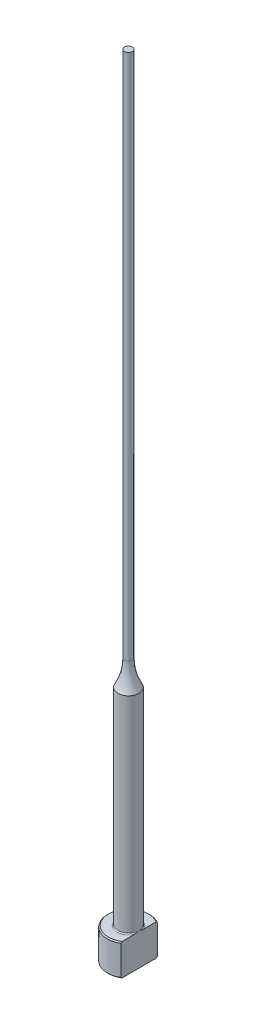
ISO-10303-21;
HEADER;
FILE_DESCRIPTION(('STEP AP214'),'2;1');
FILE_NAME('part.step','',(''),(''),'','','');
FILE_SCHEMA(('AUTOMOTIVE_DESIGN { 1 0 10303 214 1 1 1 1 }'));
ENDSEC;
DATA;
#1=APPLICATION_CONTEXT('core data for automotive mechanical design processes');
#2=APPLICATION_PROTOCOL_DEFINITION('international standard','automotive_design',2000,#1);
#3=PRODUCT_CONTEXT('',#1,'mechanical');
#4=PRODUCT('Part','Part','',(#3));
#5=PRODUCT_RELATED_PRODUCT_CATEGORY('part','',(#4));
#6=PRODUCT_DEFINITION_FORMATION('','',#4);
#7=PRODUCT_DEFINITION_CONTEXT('part definition',#1,'design');
#8=PRODUCT_DEFINITION('design','',#6,#7);
#9=PRODUCT_DEFINITION_SHAPE('','',#8);
#10=(LENGTH_UNIT() NAMED_UNIT(*) SI_UNIT(.MILLI.,.METRE.));
#11=(NAMED_UNIT(*) PLANE_ANGLE_UNIT() SI_UNIT($,.RADIAN.));
#12=(NAMED_UNIT(*) SI_UNIT($,.STERADIAN.) SOLID_ANGLE_UNIT());
#13=UNCERTAINTY_MEASURE_WITH_UNIT(LENGTH_MEASURE(1.E-05),#10,'distance_accuracy_value','');
#14=(GEOMETRIC_REPRESENTATION_CONTEXT(3) GLOBAL_UNCERTAINTY_ASSIGNED_CONTEXT((#13)) GLOBAL_UNIT_ASSIGNED_CONTEXT((#10,
#11,#12)) REPRESENTATION_CONTEXT('',''));
#15=CARTESIAN_POINT('',(0.,0.,0.));
#16=DIRECTION('',(0.,0.,1.));
#17=DIRECTION('',(1.,0.,0.));
#18=AXIS2_PLACEMENT_3D('',#15,#16,#17);
#19=CARTESIAN_POINT('',(-3.99999999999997,6.,0.));
#20=DIRECTION('',(0.,1.,0.));
#21=DIRECTION('',(0.,0.,1.));
#22=AXIS2_PLACEMENT_3D('',#19,#20,#21);
#23=PLANE('',#22);
#24=CARTESIAN_POINT('',(0.,6.,0.));
#25=DIRECTION('',(0.,1.,0.));
#26=DIRECTION('',(0.,0.,1.));
#27=AXIS2_PLACEMENT_3D('',#24,#25,#26);
#28=CIRCLE('',#27,3.79999999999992);
#29=CARTESIAN_POINT('',(1.99999999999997,6.,-3.23109888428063));
#30=VERTEX_POINT('',#29);
#31=CARTESIAN_POINT('',(1.99999999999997,6.,3.23109888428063));
#32=VERTEX_POINT('',#31);
#33=EDGE_CURVE('E187',#30,#32,#28,.T.);
#34=ORIENTED_EDGE('',*,*,#33,.T.);
#35=DIRECTION('',(0.,0.,-1.));
#36=VECTOR('',#35,1.);
#37=CARTESIAN_POINT('',(1.99999999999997,6.,0.));
#38=LINE('',#37,#36);
#39=CARTESIAN_POINT('',(1.99999999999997,5.99999999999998,0.916515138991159));
#40=VERTEX_POINT('',#39);
#41=EDGE_CURVE('E57',#32,#40,#38,.T.);
#42=ORIENTED_EDGE('',*,*,#41,.T.);
#43=CARTESIAN_POINT('',(0.,6.,0.));
#44=DIRECTION('',(0.,1.,0.));
#45=DIRECTION('',(0.,0.,1.));
#46=AXIS2_PLACEMENT_3D('',#43,#44,#45);
#47=CIRCLE('',#46,2.19999999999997);
#48=CARTESIAN_POINT('',(1.99999999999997,5.99999999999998,-0.916515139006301));
#49=VERTEX_POINT('',#48);
#50=EDGE_CURVE('E108',#40,#49,#47,.F.);
#51=ORIENTED_EDGE('',*,*,#50,.T.);
#52=EDGE_CURVE('E137',#49,#30,#38,.T.);
#53=ORIENTED_EDGE('',*,*,#52,.T.);
#54=EDGE_LOOP('',(#34,#42,#51,#53));
#55=FACE_BOUND('',#54,.T.);
#56=ADVANCED_FACE('F32',(#55),#23,.T.);
#57=CARTESIAN_POINT('',(0.,259.958771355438,0.));
#58=DIRECTION('',(0.,1.,0.));
#59=DIRECTION('',(0.,0.,1.));
#60=AXIS2_PLACEMENT_3D('',#57,#58,#59);
#61=CYLINDRICAL_SURFACE('',#60,3.99999999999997);
#62=CARTESIAN_POINT('',(0.,5.79999999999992,0.));
#63=DIRECTION('',(0.,1.,0.));
#64=DIRECTION('',(0.,0.,1.));
#65=AXIS2_PLACEMENT_3D('',#62,#63,#64);
#66=CIRCLE('',#65,3.99999999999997);
#67=CARTESIAN_POINT('',(1.99999999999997,5.79999999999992,3.46410161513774));
#68=VERTEX_POINT('',#67);
#69=CARTESIAN_POINT('',(1.99999999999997,5.79999999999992,-3.46410161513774));
#70=VERTEX_POINT('',#69);
#71=EDGE_CURVE('E105',#68,#70,#66,.F.);
#72=ORIENTED_EDGE('',*,*,#71,.T.);
#73=DIRECTION('',(0.,-1.,0.));
#74=VECTOR('',#73,1.);
#75=CARTESIAN_POINT('',(1.99999999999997,150.,-3.46410161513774));
#76=LINE('',#75,#74);
#77=CARTESIAN_POINT('',(1.99999999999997,0.199999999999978,-3.46410161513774));
#78=VERTEX_POINT('',#77);
#79=EDGE_CURVE('E193',#70,#78,#76,.T.);
#80=ORIENTED_EDGE('',*,*,#79,.T.);
#81=CARTESIAN_POINT('',(0.,0.199999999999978,0.));
#82=DIRECTION('',(0.,-1.,0.));
#83=DIRECTION('',(0.,0.,-1.));
#84=AXIS2_PLACEMENT_3D('',#81,#82,#83);
#85=CIRCLE('',#84,3.99999999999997);
#86=CARTESIAN_POINT('',(1.99999999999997,0.199999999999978,3.46410161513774));
#87=VERTEX_POINT('',#86);
#88=EDGE_CURVE('E100',#78,#87,#85,.F.);
#89=ORIENTED_EDGE('',*,*,#88,.T.);
#90=DIRECTION('',(0.,-1.,0.));
#91=VECTOR('',#90,1.);
#92=CARTESIAN_POINT('',(1.99999999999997,150.,3.46410161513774));
#93=LINE('',#92,#91);
#94=EDGE_CURVE('E93',#68,#87,#93,.T.);
#95=ORIENTED_EDGE('',*,*,#94,.F.);
#96=EDGE_LOOP('',(#72,#80,#89,#95));
#97=FACE_BOUND('',#96,.T.);
#98=ADVANCED_FACE('F158',(#97),#61,.T.);
#99=CARTESIAN_POINT('',(0.,0.,0.));
#100=DIRECTION('',(0.,-1.,0.));
#101=DIRECTION('',(0.,0.,-1.));
#102=AXIS2_PLACEMENT_3D('',#99,#100,#101);
#103=PLANE('',#102);
#104=CARTESIAN_POINT('',(0.,0.,0.));
#105=DIRECTION('',(0.,-1.,0.));
#106=DIRECTION('',(0.,0.,-1.));
#107=AXIS2_PLACEMENT_3D('',#104,#105,#106);
#108=CIRCLE('',#107,3.79999999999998);
#109=CARTESIAN_POINT('',(1.99999999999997,0.,3.2310988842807));
#110=VERTEX_POINT('',#109);
#111=CARTESIAN_POINT('',(1.99999999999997,0.,-3.2310988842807));
#112=VERTEX_POINT('',#111);
#113=EDGE_CURVE('E98',#110,#112,#108,.T.);
#114=ORIENTED_EDGE('',*,*,#113,.T.);
#115=DIRECTION('',(0.,0.,1.));
#116=VECTOR('',#115,1.);
#117=CARTESIAN_POINT('',(1.99999999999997,0.,3.46410161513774));
#118=LINE('',#117,#116);
#119=EDGE_CURVE('E83',#112,#110,#118,.T.);
#120=ORIENTED_EDGE('',*,*,#119,.T.);
#121=EDGE_LOOP('',(#114,#120));
#122=FACE_BOUND('',#121,.T.);
#123=ADVANCED_FACE('F103',(#122),#103,.T.);
#124=CARTESIAN_POINT('',(0.,6.00000000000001,0.));
#125=DIRECTION('',(0.,-1.,0.));
#126=DIRECTION('',(0.,0.,-1.));
#127=AXIS2_PLACEMENT_3D('',#124,#125,#126);
#128=CONICAL_SURFACE('',#127,3.79999999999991,0.785398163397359);
#129=ORIENTED_EDGE('',*,*,#71,.F.);
#130=CARTESIAN_POINT('',(1.99999999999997,1.91904532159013,7.62295524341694));
#131=CARTESIAN_POINT('',(1.99999999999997,2.08611243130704,7.4502239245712));
#132=CARTESIAN_POINT('',(1.99999999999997,2.25300024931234,7.27731861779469));
#133=CARTESIAN_POINT('',(1.99999999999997,2.58631125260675,6.93105655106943));
#134=CARTESIAN_POINT('',(1.99999999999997,2.75273443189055,6.75769978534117));
#135=CARTESIAN_POINT('',(1.99999999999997,3.08509080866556,6.41034692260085));
#136=CARTESIAN_POINT('',(1.99999999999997,3.25102371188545,6.23635054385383));
#137=CARTESIAN_POINT('',(1.99999999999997,3.5821559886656,5.88766284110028));
#138=CARTESIAN_POINT('',(1.99999999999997,3.74735536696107,5.71297152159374));
#139=CARTESIAN_POINT('',(1.99999999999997,4.07353855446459,5.36616839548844));
#140=CARTESIAN_POINT('',(1.99999999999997,4.23454099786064,5.19407412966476));
#141=CARTESIAN_POINT('',(1.99999999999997,4.55534102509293,4.8487666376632));
#142=CARTESIAN_POINT('',(1.99999999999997,4.71513861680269,4.67555341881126));
#143=CARTESIAN_POINT('',(1.99999999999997,5.0330618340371,4.3276656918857));
#144=CARTESIAN_POINT('',(1.99999999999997,5.1911878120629,4.15299150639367));
#145=CARTESIAN_POINT('',(1.99999999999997,5.50513944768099,3.80159134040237));
#146=CARTESIAN_POINT('',(1.99999999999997,5.66096519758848,3.62486544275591));
#147=CARTESIAN_POINT('',(1.99999999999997,5.90974646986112,3.33722425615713));
#148=CARTESIAN_POINT('',(1.99999999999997,6.00376148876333,3.22722645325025));
#149=CARTESIAN_POINT('',(1.99999999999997,6.19011825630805,3.00579987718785));
#150=CARTESIAN_POINT('',(1.99999999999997,6.28245983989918,2.89437096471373));
#151=CARTESIAN_POINT('',(1.99999999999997,6.46586188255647,2.66849662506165));
#152=CARTESIAN_POINT('',(1.99999999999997,6.55689849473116,2.55403176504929));
#153=CARTESIAN_POINT('',(1.99999999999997,6.73578809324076,2.32266819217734));
#154=CARTESIAN_POINT('',(1.99999999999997,6.82364184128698,2.20577007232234));
#155=CARTESIAN_POINT('',(1.99999999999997,6.99612756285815,1.96688707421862));
#156=CARTESIAN_POINT('',(1.99999999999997,7.08069035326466,1.84485190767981));
#157=CARTESIAN_POINT('',(1.99999999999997,7.24300264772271,1.59599329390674));
#158=CARTESIAN_POINT('',(1.99999999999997,7.32074277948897,1.46916359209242));
#159=CARTESIAN_POINT('',(1.99999999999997,7.42869763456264,1.27510066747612));
#160=CARTESIAN_POINT('',(1.99999999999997,7.46305374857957,1.21018943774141));
#161=CARTESIAN_POINT('',(1.99999999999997,7.52837146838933,1.07868835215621));
#162=CARTESIAN_POINT('',(1.99999999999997,7.55933245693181,1.01209819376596));
#163=CARTESIAN_POINT('',(1.99999999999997,7.64566860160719,0.809894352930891));
#164=CARTESIAN_POINT('',(1.99999999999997,7.69478214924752,0.6713602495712));
#165=CARTESIAN_POINT('',(1.99999999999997,7.74794829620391,0.463657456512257));
#166=CARTESIAN_POINT('',(1.99999999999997,7.76205065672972,0.397033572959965));
#167=CARTESIAN_POINT('',(1.99999999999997,7.78390371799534,0.262728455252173));
#168=CARTESIAN_POINT('',(1.99999999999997,7.79165498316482,0.195047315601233));
#169=CARTESIAN_POINT('',(1.99999999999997,7.80025690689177,0.0594528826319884));
#170=CARTESIAN_POINT('',(1.99999999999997,7.80112894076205,-0.00845903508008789));
#171=CARTESIAN_POINT('',(1.99999999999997,7.79596585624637,-0.144020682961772));
#172=CARTESIAN_POINT('',(1.99999999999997,7.78993016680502,-0.211670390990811));
#173=CARTESIAN_POINT('',(1.99999999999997,7.77145363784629,-0.345483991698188));
#174=CARTESIAN_POINT('',(1.99999999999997,7.7590677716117,-0.41165563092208));
#175=CARTESIAN_POINT('',(1.99999999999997,7.72866360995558,-0.542678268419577));
#176=CARTESIAN_POINT('',(1.99999999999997,7.71064463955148,-0.607529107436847));
#177=CARTESIAN_POINT('',(1.99999999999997,7.6697293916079,-0.736064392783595));
#178=CARTESIAN_POINT('',(1.99999999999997,7.64680564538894,-0.799739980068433));
#179=CARTESIAN_POINT('',(1.99999999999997,7.59700147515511,-0.925489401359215));
#180=CARTESIAN_POINT('',(1.99999999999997,7.57012185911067,-0.98756355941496));
#181=CARTESIAN_POINT('',(1.99999999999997,7.48443518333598,-1.17209020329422));
#182=CARTESIAN_POINT('',(1.99999999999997,7.42077407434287,-1.29228210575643));
#183=CARTESIAN_POINT('',(1.99999999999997,7.28502644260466,-1.52785770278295));
#184=CARTESIAN_POINT('',(1.99999999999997,7.21292931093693,-1.6432350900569));
#185=CARTESIAN_POINT('',(1.99999999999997,7.06281517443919,-1.87069387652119));
#186=CARTESIAN_POINT('',(1.99999999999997,6.98477595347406,-1.98276048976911));
#187=CARTESIAN_POINT('',(1.99999999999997,6.82481971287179,-2.20397837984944));
#188=CARTESIAN_POINT('',(1.99999999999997,6.74290465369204,-2.31313108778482));
#189=CARTESIAN_POINT('',(1.99999999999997,6.57517222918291,-2.53068545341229));
#190=CARTESIAN_POINT('',(1.99999999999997,6.4893176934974,-2.63905831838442));
#191=CARTESIAN_POINT('',(1.99999999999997,6.31548151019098,-2.85409686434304));
#192=CARTESIAN_POINT('',(1.99999999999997,6.22749963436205,-2.96076236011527));
#193=CARTESIAN_POINT('',(1.99999999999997,6.05015030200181,-3.17249211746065));
#194=CARTESIAN_POINT('',(1.99999999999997,5.96078672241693,-3.27755963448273));
#195=CARTESIAN_POINT('',(1.99999999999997,5.78082366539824,-3.48663191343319));
#196=CARTESIAN_POINT('',(1.99999999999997,5.69022416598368,-3.59063665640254));
#197=CARTESIAN_POINT('',(1.99999999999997,5.44796733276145,-3.86612439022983));
#198=CARTESIAN_POINT('',(1.99999999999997,5.29545972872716,-4.0368591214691));
#199=CARTESIAN_POINT('',(1.99999999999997,4.98858070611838,-4.37664803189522));
#200=CARTESIAN_POINT('',(1.99999999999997,4.83420923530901,-4.54570216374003));
#201=CARTESIAN_POINT('',(1.99999999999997,4.52396102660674,-4.88271638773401));
#202=CARTESIAN_POINT('',(1.99999999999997,4.36808300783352,-5.05067529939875));
#203=CARTESIAN_POINT('',(1.99999999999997,4.05530513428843,-5.38563883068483));
#204=CARTESIAN_POINT('',(1.99999999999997,3.8984052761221,-5.55264344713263));
#205=CARTESIAN_POINT('',(1.99999999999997,3.59029018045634,-5.87905385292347));
#206=CARTESIAN_POINT('',(1.99999999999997,3.43910664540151,-6.03848959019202));
#207=CARTESIAN_POINT('',(1.99999999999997,3.13616436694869,-6.35681456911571));
#208=CARTESIAN_POINT('',(1.99999999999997,2.98440562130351,-6.51570380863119));
#209=CARTESIAN_POINT('',(1.99999999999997,2.68059501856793,-6.83286192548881));
#210=CARTESIAN_POINT('',(1.99999999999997,2.52854367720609,-6.99113129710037));
#211=CARTESIAN_POINT('',(1.99999999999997,2.22406035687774,-7.30730102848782));
#212=CARTESIAN_POINT('',(1.99999999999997,2.07162838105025,-7.46520139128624));
#213=CARTESIAN_POINT('',(1.99999999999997,1.91904532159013,-7.62295524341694));
#214=B_SPLINE_CURVE_WITH_KNOTS('',3,(#130,#131,#132,#133,#134,#135,#136,#137,#138,#139,#140,
#141,#142,#143,#144,#145,#146,#147,#148,#149,#150,#151,#152,#153,#154,#155,#156,#157,#158,#159,
#160,#161,#162,#163,#164,#165,#166,#167,#168,#169,#170,#171,#172,#173,#174,#175,#176,#177,#178,
#179,#180,#181,#182,#183,#184,#185,#186,#187,#188,#189,#190,#191,#192,#193,#194,#195,#196,#197,
#198,#199,#200,#201,#202,#203,#204,#205,#206,#207,#208,#209,#210,#211,#212,#213),.UNSPECIFIED.,
.F.,.F.,(4,2,2,2,2,2,2,2,2,2,2,2,2,2,2,2,2,2,2,2,2,2,2,2,2,2,2,2,2,2,2,2,2,2,2,2,2,2,2,2,2,4),
(0.,0.720921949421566,1.44185317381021,2.16315326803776,2.88444869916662,3.59144103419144,
4.29842874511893,5.00526427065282,5.71207135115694,6.14616174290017,6.58029471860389,
7.01901494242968,7.45762947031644,7.90290456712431,8.34878206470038,8.56901415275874,
8.78928621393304,9.22814472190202,9.43219512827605,9.63622739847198,9.839625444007,
10.0430403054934,10.244723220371,10.4464303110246,10.6492980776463,10.8521244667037,
11.2595582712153,11.6675100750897,12.0770700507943,12.4864250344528,12.9011677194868,
13.3159550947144,13.7297367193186,14.1435257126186,14.8302935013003,15.5170805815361,
16.2045145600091,16.891950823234,17.5511045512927,18.2102608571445,18.8686819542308,
19.5270976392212),.UNSPECIFIED.);
#215=EDGE_CURVE('E136',#68,#32,#214,.T.);
#216=ORIENTED_EDGE('',*,*,#215,.T.);
#217=ORIENTED_EDGE('',*,*,#33,.F.);
#218=EDGE_CURVE('E128',#30,#70,#214,.T.);
#219=ORIENTED_EDGE('',*,*,#218,.T.);
#220=EDGE_LOOP('',(#129,#216,#217,#219));
#221=FACE_BOUND('',#220,.T.);
#222=ADVANCED_FACE('F144',(#221),#128,.T.);
#223=CARTESIAN_POINT('',(0.,0.199999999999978,0.));
#224=DIRECTION('',(0.,1.,0.));
#225=DIRECTION('',(0.,0.,1.));
#226=AXIS2_PLACEMENT_3D('',#223,#224,#225);
#227=CONICAL_SURFACE('',#226,3.99999999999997,0.785398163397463);
#228=ORIENTED_EDGE('',*,*,#88,.F.);
#229=CARTESIAN_POINT('',(1.99999999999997,4.08095467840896,-7.62295524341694));
#230=CARTESIAN_POINT('',(1.99999999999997,3.9138875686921,-7.45022392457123));
#231=CARTESIAN_POINT('',(1.99999999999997,3.74699975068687,-7.27731861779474));
#232=CARTESIAN_POINT('',(1.99999999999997,3.41368874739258,-6.93105655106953));
#233=CARTESIAN_POINT('',(1.99999999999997,3.24726556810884,-6.7576997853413));
#234=CARTESIAN_POINT('',(1.99999999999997,2.91490919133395,-6.41034692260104));
#235=CARTESIAN_POINT('',(1.99999999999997,2.74897628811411,-6.23635054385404));
#236=CARTESIAN_POINT('',(1.99999999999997,2.41784401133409,-5.88766284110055));
#237=CARTESIAN_POINT('',(1.99999999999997,2.25264463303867,-5.71297152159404));
#238=CARTESIAN_POINT('',(1.99999999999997,1.92646144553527,-5.36616839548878));
#239=CARTESIAN_POINT('',(1.99999999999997,1.76545900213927,-5.19407412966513));
#240=CARTESIAN_POINT('',(1.99999999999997,1.44465897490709,-4.84876663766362));
#241=CARTESIAN_POINT('',(1.99999999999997,1.28486138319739,-4.6755534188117));
#242=CARTESIAN_POINT('',(1.99999999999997,0.966938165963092,-4.3276656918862));
#243=CARTESIAN_POINT('',(1.99999999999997,0.808812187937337,-4.1529915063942));
#244=CARTESIAN_POINT('',(1.99999999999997,0.49486055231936,-3.80159134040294));
#245=CARTESIAN_POINT('',(1.99999999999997,0.33903480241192,-3.62486544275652));
#246=CARTESIAN_POINT('',(1.99999999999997,0.0902535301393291,-3.33722425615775));
#247=CARTESIAN_POINT('',(1.99999999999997,-0.0037614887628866,-3.22722645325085));
#248=CARTESIAN_POINT('',(1.99999999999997,-0.190118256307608,-3.00579987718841));
#249=CARTESIAN_POINT('',(1.99999999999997,-0.282459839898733,-2.89437096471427));
#250=CARTESIAN_POINT('',(1.99999999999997,-0.465861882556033,-2.66849662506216));
#251=CARTESIAN_POINT('',(1.99999999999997,-0.556898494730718,-2.55403176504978));
#252=CARTESIAN_POINT('',(1.99999999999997,-0.735788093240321,-2.3226681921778));
#253=CARTESIAN_POINT('',(1.99999999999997,-0.823641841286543,-2.20577007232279));
#254=CARTESIAN_POINT('',(1.99999999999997,-0.99612756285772,-1.96688707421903));
#255=CARTESIAN_POINT('',(1.99999999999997,-1.08069035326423,-1.84485190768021));
#256=CARTESIAN_POINT('',(1.99999999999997,-1.24300264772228,-1.59599329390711));
#257=CARTESIAN_POINT('',(1.99999999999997,-1.32074277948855,-1.46916359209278));
#258=CARTESIAN_POINT('',(1.99999999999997,-1.42869763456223,-1.27510066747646));
#259=CARTESIAN_POINT('',(1.99999999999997,-1.46305374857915,-1.21018943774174));
#260=CARTESIAN_POINT('',(1.99999999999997,-1.52837146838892,-1.07868835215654));
#261=CARTESIAN_POINT('',(1.99999999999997,-1.5593324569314,-1.01209819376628));
#262=CARTESIAN_POINT('',(1.99999999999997,-1.6456686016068,-0.809894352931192));
#263=CARTESIAN_POINT('',(1.99999999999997,-1.69478214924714,-0.671360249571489));
#264=CARTESIAN_POINT('',(1.99999999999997,-1.74794829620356,-0.463657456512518));
#265=CARTESIAN_POINT('',(1.99999999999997,-1.76205065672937,-0.397033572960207));
#266=CARTESIAN_POINT('',(1.99999999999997,-1.78390371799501,-0.262728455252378));
#267=CARTESIAN_POINT('',(1.99999999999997,-1.7916549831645,-0.195047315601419));
#268=CARTESIAN_POINT('',(1.99999999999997,-1.80025690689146,-0.0594528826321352));
#269=CARTESIAN_POINT('',(1.99999999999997,-1.80112894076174,0.00845903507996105));
#270=CARTESIAN_POINT('',(1.99999999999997,-1.79596585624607,0.144020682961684));
#271=CARTESIAN_POINT('',(1.99999999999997,-1.78993016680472,0.211670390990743));
#272=CARTESIAN_POINT('',(1.99999999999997,-1.77145363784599,0.345483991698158));
#273=CARTESIAN_POINT('',(1.99999999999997,-1.7590677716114,0.411655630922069));
#274=CARTESIAN_POINT('',(1.99999999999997,-1.72866360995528,0.542678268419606));
#275=CARTESIAN_POINT('',(1.99999999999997,-1.71064463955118,0.607529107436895));
#276=CARTESIAN_POINT('',(1.99999999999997,-1.66972939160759,0.736064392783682));
#277=CARTESIAN_POINT('',(1.99999999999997,-1.64680564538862,0.799739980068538));
#278=CARTESIAN_POINT('',(1.99999999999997,-1.59700147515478,0.925489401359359));
#279=CARTESIAN_POINT('',(1.99999999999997,-1.57012185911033,0.987563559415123));
#280=CARTESIAN_POINT('',(1.99999999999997,-1.48443518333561,1.17209020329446));
#281=CARTESIAN_POINT('',(1.99999999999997,-1.42077407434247,1.29228210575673));
#282=CARTESIAN_POINT('',(1.99999999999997,-1.28502644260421,1.52785770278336));
#283=CARTESIAN_POINT('',(1.99999999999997,-1.21292931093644,1.64323509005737));
#284=CARTESIAN_POINT('',(1.99999999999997,-1.06281517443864,1.87069387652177));
#285=CARTESIAN_POINT('',(1.99999999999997,-0.984775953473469,1.98276048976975));
#286=CARTESIAN_POINT('',(1.99999999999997,-0.824819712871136,2.20397837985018));
#287=CARTESIAN_POINT('',(1.99999999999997,-0.742904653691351,2.31313108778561));
#288=CARTESIAN_POINT('',(1.99999999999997,-0.575172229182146,2.53068545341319));
#289=CARTESIAN_POINT('',(1.99999999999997,-0.489317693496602,2.63905831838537));
#290=CARTESIAN_POINT('',(1.99999999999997,-0.315481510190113,2.8540968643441));
#291=CARTESIAN_POINT('',(1.99999999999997,-0.227499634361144,2.96076236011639));
#292=CARTESIAN_POINT('',(1.99999999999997,-0.0501503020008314,3.17249211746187));
#293=CARTESIAN_POINT('',(1.99999999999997,0.039213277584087,3.277559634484));
#294=CARTESIAN_POINT('',(1.99999999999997,0.219176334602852,3.48663191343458));
#295=CARTESIAN_POINT('',(1.99999999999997,0.309775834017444,3.59063665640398));
#296=CARTESIAN_POINT('',(1.99999999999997,0.552032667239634,3.86612439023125));
#297=CARTESIAN_POINT('',(1.99999999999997,0.704540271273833,4.03685912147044));
#298=CARTESIAN_POINT('',(1.99999999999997,1.01141929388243,4.37664803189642));
#299=CARTESIAN_POINT('',(1.99999999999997,1.16579076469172,4.54570216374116));
#300=CARTESIAN_POINT('',(1.99999999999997,1.47603897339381,4.88271638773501));
#301=CARTESIAN_POINT('',(1.99999999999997,1.63191699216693,5.05067529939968));
#302=CARTESIAN_POINT('',(1.99999999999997,1.94469486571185,5.38563883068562));
#303=CARTESIAN_POINT('',(1.99999999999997,2.10159472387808,5.55264344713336));
#304=CARTESIAN_POINT('',(1.99999999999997,2.40970981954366,5.87905385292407));
#305=CARTESIAN_POINT('',(1.99999999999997,2.56089335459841,6.03848959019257));
#306=CARTESIAN_POINT('',(1.99999999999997,2.86383563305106,6.35681456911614));
#307=CARTESIAN_POINT('',(1.99999999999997,3.01559437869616,6.51570380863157));
#308=CARTESIAN_POINT('',(1.99999999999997,3.31940498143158,6.83286192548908));
#309=CARTESIAN_POINT('',(1.99999999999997,3.47145632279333,6.99113129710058));
#310=CARTESIAN_POINT('',(1.99999999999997,3.77593964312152,7.30730102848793));
#311=CARTESIAN_POINT('',(1.99999999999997,3.92837161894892,7.46520139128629));
#312=CARTESIAN_POINT('',(1.99999999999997,4.08095467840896,7.62295524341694));
#313=B_SPLINE_CURVE_WITH_KNOTS('',3,(#229,#230,#231,#232,#233,#234,#235,#236,#237,#238,#239,
#240,#241,#242,#243,#244,#245,#246,#247,#248,#249,#250,#251,#252,#253,#254,#255,#256,#257,#258,
#259,#260,#261,#262,#263,#264,#265,#266,#267,#268,#269,#270,#271,#272,#273,#274,#275,#276,#277,
#278,#279,#280,#281,#282,#283,#284,#285,#286,#287,#288,#289,#290,#291,#292,#293,#294,#295,#296,
#297,#298,#299,#300,#301,#302,#303,#304,#305,#306,#307,#308,#309,#310,#311,#312),.UNSPECIFIED.,
.F.,.F.,(4,2,2,2,2,2,2,2,2,2,2,2,2,2,2,2,2,2,2,2,2,2,2,2,2,2,2,2,2,2,2,2,2,2,2,2,2,2,2,2,2,4),
(0.,0.720921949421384,1.44185317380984,2.16315326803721,2.88444869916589,3.59144103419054,
4.29842874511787,5.00526427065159,5.71207135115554,6.14616174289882,6.58029471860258,
7.01901494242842,7.45762947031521,7.90290456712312,8.34878206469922,8.56901415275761,
8.78928621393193,9.22814472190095,9.43219512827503,9.63622739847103,9.83962544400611,
10.0430403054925,10.2447232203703,10.4464303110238,10.6492980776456,10.8521244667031,
11.2595582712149,11.6675100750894,12.0770700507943,12.486425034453,12.9011677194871,
13.3159550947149,13.7297367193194,14.1435257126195,14.8302935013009,15.5170805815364,
16.204514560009,16.8919508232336,17.551104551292,18.2102608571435,18.8686819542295,
19.5270976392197),.UNSPECIFIED.);
#314=EDGE_CURVE('E86',#78,#112,#313,.T.);
#315=ORIENTED_EDGE('',*,*,#314,.T.);
#316=ORIENTED_EDGE('',*,*,#113,.F.);
#317=EDGE_CURVE('E89',#110,#87,#313,.T.);
#318=ORIENTED_EDGE('',*,*,#317,.T.);
#319=EDGE_LOOP('',(#228,#315,#316,#318));
#320=FACE_BOUND('',#319,.T.);
#321=ADVANCED_FACE('F97',(#320),#227,.T.);
#322=CARTESIAN_POINT('',(0.,6.19999999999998,0.));
#323=DIRECTION('',(0.,1.,0.));
#324=DIRECTION('',(0.,0.,1.));
#325=AXIS2_PLACEMENT_3D('',#322,#323,#324);
#326=TOROIDAL_SURFACE('',#325,2.19999999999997,0.2);
#327=CARTESIAN_POINT('',(1.99999999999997,6.19999999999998,0.));
#328=CARTESIAN_POINT('',(1.99999999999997,6.20000050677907,1.13930141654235E-10));
#329=CARTESIAN_POINT('',(1.99999999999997,6.20000101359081,-1.46766795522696E-07));
#330=CARTESIAN_POINT('',(1.99999999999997,6.20000197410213,-5.82067451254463E-07));
#331=CARTESIAN_POINT('',(1.99999999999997,6.20000242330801,-8.77873018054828E-07));
#332=CARTESIAN_POINT('',(1.99999999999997,6.2000033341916,-1.5842451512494E-06));
#333=CARTESIAN_POINT('',(1.99999999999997,6.20000378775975,-2.00534283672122E-06));
#334=CARTESIAN_POINT('',(1.99999999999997,6.20000462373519,-2.89558841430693E-06));
#335=CARTESIAN_POINT('',(1.99999999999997,6.20000500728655,-3.36372325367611E-06));
#336=CARTESIAN_POINT('',(1.99999999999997,6.20000636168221,-5.10887550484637E-06));
#337=CARTESIAN_POINT('',(1.99999999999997,6.20000725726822,-6.44597279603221E-06));
#338=CARTESIAN_POINT('',(1.99999999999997,6.20000879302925,-9.14926716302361E-06));
#339=CARTESIAN_POINT('',(1.99999999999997,6.20000944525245,-1.0508971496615E-05));
#340=CARTESIAN_POINT('',(1.99999999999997,6.20001204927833,-1.60555880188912E-05));
#341=CARTESIAN_POINT('',(1.99999999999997,6.20001390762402,-2.02908747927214E-05));
#342=CARTESIAN_POINT('',(1.99999999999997,6.20001676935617,-2.84438494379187E-05));
#343=CARTESIAN_POINT('',(1.99999999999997,6.20001785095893,-3.23343259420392E-05));
#344=CARTESIAN_POINT('',(1.99999999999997,6.20002551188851,-6.06027145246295E-05));
#345=CARTESIAN_POINT('',(1.99999999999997,6.20003111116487,-8.51991847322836E-05));
#346=CARTESIAN_POINT('',(1.99999999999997,6.20005559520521,-0.00018156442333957));
#347=CARTESIAN_POINT('',(1.99999999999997,6.20007914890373,-0.000252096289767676));
#348=CARTESIAN_POINT('',(1.99999999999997,6.20017002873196,-0.00052958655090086));
#349=CARTESIAN_POINT('',(1.99999999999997,6.20023415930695,-0.00073729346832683));
#350=CARTESIAN_POINT('',(1.99999999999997,6.20048926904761,-0.00155657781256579));
#351=CARTESIAN_POINT('',(1.99999999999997,6.20068414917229,-0.00216722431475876));
#352=CARTESIAN_POINT('',(1.99999999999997,6.20148805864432,-0.0046938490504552));
#353=CARTESIAN_POINT('',(1.99999999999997,6.20209226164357,-0.00661098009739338));
#354=CARTESIAN_POINT('',(1.99999999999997,6.20822779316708,-0.026069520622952));
#355=CARTESIAN_POINT('',(1.99999999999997,6.21378174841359,-0.0436057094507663));
#356=CARTESIAN_POINT('',(1.99999999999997,6.22462834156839,-0.0780127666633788));
#357=CARTESIAN_POINT('',(1.99999999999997,6.22992277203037,-0.0948831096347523));
#358=CARTESIAN_POINT('',(1.99999999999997,6.24110477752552,-0.130713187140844));
#359=CARTESIAN_POINT('',(1.99999999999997,6.24698536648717,-0.149675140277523));
#360=CARTESIAN_POINT('',(1.99999999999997,6.25869835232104,-0.187834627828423));
#361=CARTESIAN_POINT('',(1.99999999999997,6.26452957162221,-0.207032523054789));
#362=CARTESIAN_POINT('',(1.99999999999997,6.27861584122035,-0.254071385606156));
#363=CARTESIAN_POINT('',(1.99999999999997,6.28678835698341,-0.281937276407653));
#364=CARTESIAN_POINT('',(1.99999999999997,6.30249503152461,-0.33711523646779));
#365=CARTESIAN_POINT('',(1.99999999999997,6.31003989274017,-0.364424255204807));
#366=CARTESIAN_POINT('',(1.99999999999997,6.32554795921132,-0.422841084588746));
#367=CARTESIAN_POINT('',(1.99999999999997,6.33343288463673,-0.453970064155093));
#368=CARTESIAN_POINT('',(1.99999999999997,6.34833120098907,-0.516667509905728));
#369=CARTESIAN_POINT('',(1.99999999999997,6.3553379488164,-0.548237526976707));
#370=CARTESIAN_POINT('',(1.99999999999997,6.37554978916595,-0.647984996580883));
#371=CARTESIAN_POINT('',(1.99999999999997,6.38665117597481,-0.716635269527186));
#372=CARTESIAN_POINT('',(1.99999999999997,6.39785773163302,-0.8324457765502));
#373=CARTESIAN_POINT('',(1.99999999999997,6.40036304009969,-0.879345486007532));
#374=CARTESIAN_POINT('',(1.99999999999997,6.39976024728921,-0.949238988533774));
#375=CARTESIAN_POINT('',(1.99999999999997,6.39886048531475,-0.97224857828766));
#376=CARTESIAN_POINT('',(1.99999999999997,6.39534463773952,-1.01812773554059));
#377=CARTESIAN_POINT('',(1.99999999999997,6.39273014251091,-1.04099741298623));
#378=CARTESIAN_POINT('',(1.99999999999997,6.38623968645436,-1.08102660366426));
#379=CARTESIAN_POINT('',(1.99999999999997,6.38280841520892,-1.09825717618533));
#380=CARTESIAN_POINT('',(1.99999999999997,6.37442567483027,-1.13243508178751));
#381=CARTESIAN_POINT('',(1.99999999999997,6.36946777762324,-1.14938089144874));
#382=CARTESIAN_POINT('',(1.99999999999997,6.35764172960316,-1.18276398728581));
#383=CARTESIAN_POINT('',(1.99999999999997,6.35075810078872,-1.1991959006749));
#384=CARTESIAN_POINT('',(1.99999999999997,6.33462082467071,-1.23083581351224));
#385=CARTESIAN_POINT('',(1.99999999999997,6.32537783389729,-1.24604892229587));
#386=CARTESIAN_POINT('',(1.99999999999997,6.30929159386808,-1.26715296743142));
#387=CARTESIAN_POINT('',(1.99999999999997,6.303567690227,-1.27389441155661));
#388=CARTESIAN_POINT('',(1.99999999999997,6.29128925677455,-1.28659894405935));
#389=CARTESIAN_POINT('',(1.99999999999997,6.28473413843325,-1.29256147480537));
#390=CARTESIAN_POINT('',(1.99999999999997,6.27066594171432,-1.30346436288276));
#391=CARTESIAN_POINT('',(1.99999999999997,6.26314132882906,-1.30839014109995));
#392=CARTESIAN_POINT('',(1.99999999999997,6.24727957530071,-1.31668687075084));
#393=CARTESIAN_POINT('',(1.99999999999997,6.23894498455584,-1.32006252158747));
#394=CARTESIAN_POINT('',(1.99999999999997,6.22424089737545,-1.3241557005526));
#395=CARTESIAN_POINT('',(1.99999999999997,6.21800630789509,-1.32536112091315));
#396=CARTESIAN_POINT('',(1.99999999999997,6.20542266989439,-1.32669615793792));
#397=CARTESIAN_POINT('',(1.99999999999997,6.19907368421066,-1.32682634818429));
#398=CARTESIAN_POINT('',(1.99999999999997,6.18645152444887,-1.32599950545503));
#399=CARTESIAN_POINT('',(1.99999999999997,6.18017831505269,-1.32504300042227));
#400=CARTESIAN_POINT('',(1.99999999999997,6.16787181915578,-1.32212308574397));
#401=CARTESIAN_POINT('',(1.99999999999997,6.16183869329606,-1.32015901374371));
#402=CARTESIAN_POINT('',(1.99999999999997,6.14844260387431,-1.31466566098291));
#403=CARTESIAN_POINT('',(1.99999999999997,6.14119825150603,-1.3108482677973));
#404=CARTESIAN_POINT('',(1.99999999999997,6.12742328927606,-1.30209252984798));
#405=CARTESIAN_POINT('',(1.99999999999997,6.12089414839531,-1.29715193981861));
#406=CARTESIAN_POINT('',(1.99999999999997,6.10554761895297,-1.28382084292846));
#407=CARTESIAN_POINT('',(1.99999999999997,6.09717242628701,-1.27492468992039));
#408=CARTESIAN_POINT('',(1.99999999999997,6.08188323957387,-1.25597903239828));
#409=CARTESIAN_POINT('',(1.99999999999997,6.07497120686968,-1.24592800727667));
#410=CARTESIAN_POINT('',(1.99999999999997,6.05771073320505,-1.21734573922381));
#411=CARTESIAN_POINT('',(1.99999999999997,6.04862251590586,-1.19806017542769));
#412=CARTESIAN_POINT('',(1.99999999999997,6.03323781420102,-1.15830155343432));
#413=CARTESIAN_POINT('',(1.99999999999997,6.02696471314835,-1.13782009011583));
#414=CARTESIAN_POINT('',(1.99999999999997,6.01659159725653,-1.09607450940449));
#415=CARTESIAN_POINT('',(1.99999999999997,6.01251776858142,-1.07480405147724));
#416=CARTESIAN_POINT('',(1.99999999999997,6.0061890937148,-1.03196822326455));
#417=CARTESIAN_POINT('',(1.99999999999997,6.00393768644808,-1.0104023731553));
#418=CARTESIAN_POINT('',(1.99999999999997,5.99950887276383,-0.946948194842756));
#419=CARTESIAN_POINT('',(1.99999999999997,5.99937097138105,-0.904921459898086));
#420=CARTESIAN_POINT('',(1.99999999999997,6.00391139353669,-0.800067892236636));
#421=CARTESIAN_POINT('',(1.99999999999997,6.01103947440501,-0.737378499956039));
#422=CARTESIAN_POINT('',(1.99999999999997,6.0310998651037,-0.61144432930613));
#423=CARTESIAN_POINT('',(1.99999999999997,6.04417074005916,-0.54822386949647));
#424=CARTESIAN_POINT('',(1.99999999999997,6.06920011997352,-0.442888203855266));
#425=CARTESIAN_POINT('',(1.99999999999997,6.08016343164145,-0.400527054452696));
#426=CARTESIAN_POINT('',(1.99999999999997,6.10315303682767,-0.316588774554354));
#427=CARTESIAN_POINT('',(1.99999999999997,6.11516655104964,-0.275008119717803));
#428=CARTESIAN_POINT('',(1.99999999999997,6.13853403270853,-0.196672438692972));
#429=CARTESIAN_POINT('',(1.99999999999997,6.14981294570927,-0.159894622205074));
#430=CARTESIAN_POINT('',(1.99999999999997,6.17316886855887,-0.0849211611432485));
#431=CARTESIAN_POINT('',(1.99999999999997,6.18525959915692,-0.046729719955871));
#432=CARTESIAN_POINT('',(1.99999999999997,6.1979086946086,-0.00660765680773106));
#433=CARTESIAN_POINT('',(1.99999999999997,6.19851400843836,-0.00468723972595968));
#434=CARTESIAN_POINT('',(1.99999999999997,6.199318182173,-0.00215985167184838));
#435=CARTESIAN_POINT('',(1.99999999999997,6.19951225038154,-0.0015517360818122));
#436=CARTESIAN_POINT('',(1.99999999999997,6.19976637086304,-0.000735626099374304));
#437=CARTESIAN_POINT('',(1.99999999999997,6.19983030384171,-0.000528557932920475));
#438=CARTESIAN_POINT('',(1.99999999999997,6.19992094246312,-0.00025181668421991));
#439=CARTESIAN_POINT('',(1.99999999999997,6.1999444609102,-0.000181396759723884));
#440=CARTESIAN_POINT('',(1.99999999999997,6.19996891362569,-8.51622338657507E-05));
#441=CARTESIAN_POINT('',(1.99999999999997,6.19997450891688,-6.05824645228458E-05));
#442=CARTESIAN_POINT('',(1.99999999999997,6.19998216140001,-3.23308902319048E-05));
#443=CARTESIAN_POINT('',(1.99999999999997,6.19998324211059,-2.8441435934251E-05));
#444=CARTESIAN_POINT('',(1.99999999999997,6.19998610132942,-2.02904710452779E-05));
#445=CARTESIAN_POINT('',(1.99999999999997,6.19998795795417,-1.6056119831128E-05));
#446=CARTESIAN_POINT('',(1.99999999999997,6.19999055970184,-1.05104411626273E-05));
#447=CARTESIAN_POINT('',(1.99999999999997,6.19999121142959,-9.15081317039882E-06));
#448=CARTESIAN_POINT('',(1.99999999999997,6.19999274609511,-6.44758195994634E-06));
#449=CARTESIAN_POINT('',(1.99999999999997,6.19999364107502,-5.11046373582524E-06));
#450=CARTESIAN_POINT('',(1.99999999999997,6.1999949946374,-3.36517635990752E-06));
#451=CARTESIAN_POINT('',(1.99999999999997,6.19999537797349,-2.8969795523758E-06));
#452=CARTESIAN_POINT('',(1.99999999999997,6.19999621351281,-2.00657125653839E-06));
#453=CARTESIAN_POINT('',(1.99999999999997,6.19999666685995,-1.58537196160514E-06));
#454=CARTESIAN_POINT('',(1.99999999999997,6.19999757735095,-8.78757217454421E-07));
#455=CARTESIAN_POINT('',(1.99999999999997,6.19999802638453,-5.82817893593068E-07));
#456=CARTESIAN_POINT('',(1.99999999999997,6.19999898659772,-1.47186735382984E-07));
#457=CARTESIAN_POINT('',(1.99999999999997,6.19999949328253,-1.13916285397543E-10));
#458=CARTESIAN_POINT('',(1.99999999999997,6.19999999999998,0.));
#459=B_SPLINE_CURVE_WITH_KNOTS('',3,(#327,#328,#329,#330,#331,#332,#333,#334,#335,#336,#337,
#338,#339,#340,#341,#342,#343,#344,#345,#346,#347,#348,#349,#350,#351,#352,#353,#354,#355,#356,
#357,#358,#359,#360,#361,#362,#363,#364,#365,#366,#367,#368,#369,#370,#371,#372,#373,#374,#375,
#376,#377,#378,#379,#380,#381,#382,#383,#384,#385,#386,#387,#388,#389,#390,#391,#392,#393,#394,
#395,#396,#397,#398,#399,#400,#401,#402,#403,#404,#405,#406,#407,#408,#409,#410,#411,#412,#413,
#414,#415,#416,#417,#418,#419,#420,#421,#422,#423,#424,#425,#426,#427,#428,#429,#430,#431,#432,
#433,#434,#435,#436,#437,#438,#439,#440,#441,#442,#443,#444,#445,#446,#447,#448,#449,#450,#451,
#452,#453,#454,#455,#456,#457,#458),.UNSPECIFIED.,.T.,.F.,(4,2,2,2,2,2,2,2,2,2,2,2,2,2,2,2,2,2,
2,2,2,2,2,2,2,2,2,2,2,2,2,2,2,2,2,2,2,2,2,2,2,2,2,2,2,2,2,2,2,2,2,2,2,2,2,2,2,2,2,2,2,2,2,2,2,
4),(0.,1.5236988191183E-06,3.13175174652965E-06,4.9793386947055E-06,6.79332712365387E-06,
1.16005918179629E-05,1.61211188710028E-05,2.99630983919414E-05,4.20611839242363E-05,
0.000117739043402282,0.000340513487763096,0.000992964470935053,0.00291555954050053,
0.00894623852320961,0.0641278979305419,0.117173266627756,0.176731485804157,0.23692308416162,
0.324038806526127,0.409031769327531,0.505353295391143,0.602364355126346,0.810598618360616,
0.951214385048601,1.02024793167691,1.08921754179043,1.14187257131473,1.19475241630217,
1.24807013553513,1.30115116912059,1.32762610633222,1.35411989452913,1.38096446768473,
1.40772711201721,1.42669285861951,1.44564848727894,1.46459491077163,1.48355380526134,
1.50798338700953,1.53246223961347,1.56891061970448,1.60540755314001,1.6690093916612,
1.73313017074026,1.79799846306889,1.86298887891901,1.9887768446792,2.17764082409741,
2.37115413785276,2.50240556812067,2.63223743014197,2.74764208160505,2.86781494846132,
2.87385601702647,2.8757706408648,2.87642108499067,2.87664350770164,2.87671913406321,
2.87673122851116,2.87674506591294,2.87674958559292,2.87675439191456,2.87675620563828,
2.87675805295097,2.87675966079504,2.87676118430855),.UNSPECIFIED.);
#460=CARTESIAN_POINT('',(1.99999999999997,6.19999999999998,0.));
#461=VERTEX_POINT('',#460);
#462=EDGE_CURVE('E11',#49,#461,#459,.T.);
#463=ORIENTED_EDGE('',*,*,#462,.F.);
#464=ORIENTED_EDGE('',*,*,#50,.F.);
#465=CARTESIAN_POINT('',(1.99999999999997,6.19999999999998,0.));
#466=CARTESIAN_POINT('',(1.99999999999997,6.19999949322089,-1.13930155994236E-10));
#467=CARTESIAN_POINT('',(1.99999999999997,6.19999898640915,1.46766795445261E-07));
#468=CARTESIAN_POINT('',(1.99999999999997,6.19999802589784,5.8206745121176E-07));
#469=CARTESIAN_POINT('',(1.99999999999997,6.19999757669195,8.77873018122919E-07));
#470=CARTESIAN_POINT('',(1.99999999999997,6.19999666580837,1.58424515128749E-06));
#471=CARTESIAN_POINT('',(1.99999999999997,6.19999621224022,2.00534283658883E-06));
#472=CARTESIAN_POINT('',(1.99999999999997,6.19999537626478,2.8955884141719E-06));
#473=CARTESIAN_POINT('',(1.99999999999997,6.19999499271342,3.36372325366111E-06));
#474=CARTESIAN_POINT('',(1.99999999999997,6.19999363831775,5.10887550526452E-06));
#475=CARTESIAN_POINT('',(1.99999999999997,6.19999274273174,6.44597279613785E-06));
#476=CARTESIAN_POINT('',(1.99999999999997,6.19999120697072,9.14926716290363E-06));
#477=CARTESIAN_POINT('',(1.99999999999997,6.19999055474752,1.05089714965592E-05));
#478=CARTESIAN_POINT('',(1.99999999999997,6.19998795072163,1.60555880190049E-05));
#479=CARTESIAN_POINT('',(1.99999999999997,6.19998609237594,2.02908747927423E-05));
#480=CARTESIAN_POINT('',(1.99999999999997,6.1999832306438,2.84438494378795E-05));
#481=CARTESIAN_POINT('',(1.99999999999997,6.19998214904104,3.23343259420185E-05));
#482=CARTESIAN_POINT('',(1.99999999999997,6.19997448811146,6.06027145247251E-05));
#483=CARTESIAN_POINT('',(1.99999999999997,6.1999688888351,8.51991847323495E-05));
#484=CARTESIAN_POINT('',(1.99999999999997,6.19994440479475,0.000181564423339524));
#485=CARTESIAN_POINT('',(1.99999999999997,6.19992085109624,0.000252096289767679));
#486=CARTESIAN_POINT('',(1.99999999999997,6.199829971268,0.000529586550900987));
#487=CARTESIAN_POINT('',(1.99999999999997,6.19976584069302,0.000737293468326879));
#488=CARTESIAN_POINT('',(1.99999999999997,6.19951073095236,0.00155657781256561));
#489=CARTESIAN_POINT('',(1.99999999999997,6.19931585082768,0.00216722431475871));
#490=CARTESIAN_POINT('',(1.99999999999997,6.19851194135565,0.00469384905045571));
#491=CARTESIAN_POINT('',(1.99999999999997,6.1979077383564,0.00661098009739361));
#492=CARTESIAN_POINT('',(1.99999999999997,6.19177220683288,0.0260695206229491));
#493=CARTESIAN_POINT('',(1.99999999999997,6.18621825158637,0.0436057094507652));
#494=CARTESIAN_POINT('',(1.99999999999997,6.17537165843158,0.078012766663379));
#495=CARTESIAN_POINT('',(1.99999999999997,6.1700772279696,0.0948831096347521));
#496=CARTESIAN_POINT('',(1.99999999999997,6.15889522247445,0.130713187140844));
#497=CARTESIAN_POINT('',(1.99999999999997,6.1530146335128,0.149675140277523));
#498=CARTESIAN_POINT('',(1.99999999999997,6.14130164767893,0.187834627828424));
#499=CARTESIAN_POINT('',(1.99999999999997,6.13547042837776,0.207032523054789));
#500=CARTESIAN_POINT('',(1.99999999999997,6.12138415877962,0.254071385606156));
#501=CARTESIAN_POINT('',(1.99999999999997,6.11321164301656,0.281937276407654));
#502=CARTESIAN_POINT('',(1.99999999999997,6.09750496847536,0.337115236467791));
#503=CARTESIAN_POINT('',(1.99999999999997,6.0899601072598,0.364424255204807));
#504=CARTESIAN_POINT('',(1.99999999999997,6.07445204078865,0.422841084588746));
#505=CARTESIAN_POINT('',(1.99999999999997,6.06656711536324,0.453970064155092));
#506=CARTESIAN_POINT('',(1.99999999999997,6.0516687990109,0.516667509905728));
#507=CARTESIAN_POINT('',(1.99999999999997,6.04466205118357,0.548237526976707));
#508=CARTESIAN_POINT('',(1.99999999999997,6.02445021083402,0.647984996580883));
#509=CARTESIAN_POINT('',(1.99999999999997,6.01334882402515,0.716635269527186));
#510=CARTESIAN_POINT('',(1.99999999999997,6.00214226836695,0.8324457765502));
#511=CARTESIAN_POINT('',(1.99999999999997,5.99963695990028,0.879345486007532));
#512=CARTESIAN_POINT('',(1.99999999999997,6.00023975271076,0.949238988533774));
#513=CARTESIAN_POINT('',(1.99999999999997,6.00113951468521,0.972248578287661));
#514=CARTESIAN_POINT('',(1.99999999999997,6.00465536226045,1.01812773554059));
#515=CARTESIAN_POINT('',(1.99999999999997,6.00726985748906,1.04099741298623));
#516=CARTESIAN_POINT('',(1.99999999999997,6.01376031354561,1.08102660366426));
#517=CARTESIAN_POINT('',(1.99999999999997,6.01719158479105,1.09825717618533));
#518=CARTESIAN_POINT('',(1.99999999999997,6.02557432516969,1.13243508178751));
#519=CARTESIAN_POINT('',(1.99999999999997,6.03053222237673,1.14938089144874));
#520=CARTESIAN_POINT('',(1.99999999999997,6.04235827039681,1.18276398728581));
#521=CARTESIAN_POINT('',(1.99999999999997,6.04924189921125,1.1991959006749));
#522=CARTESIAN_POINT('',(1.99999999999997,6.06537917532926,1.23083581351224));
#523=CARTESIAN_POINT('',(1.99999999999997,6.07462216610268,1.24604892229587));
#524=CARTESIAN_POINT('',(1.99999999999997,6.09070840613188,1.26715296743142));
#525=CARTESIAN_POINT('',(1.99999999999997,6.09643230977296,1.27389441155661));
#526=CARTESIAN_POINT('',(1.99999999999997,6.10871074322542,1.28659894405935));
#527=CARTESIAN_POINT('',(1.99999999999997,6.11526586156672,1.29256147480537));
#528=CARTESIAN_POINT('',(1.99999999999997,6.12933405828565,1.30346436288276));
#529=CARTESIAN_POINT('',(1.99999999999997,6.1368586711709,1.30839014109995));
#530=CARTESIAN_POINT('',(1.99999999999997,6.15272042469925,1.31668687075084));
#531=CARTESIAN_POINT('',(1.99999999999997,6.16105501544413,1.32006252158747));
#532=CARTESIAN_POINT('',(1.99999999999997,6.17575910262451,1.3241557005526));
#533=CARTESIAN_POINT('',(1.99999999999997,6.18199369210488,1.32536112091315));
#534=CARTESIAN_POINT('',(1.99999999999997,6.19457733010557,1.32669615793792));
#535=CARTESIAN_POINT('',(1.99999999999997,6.20092631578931,1.32682634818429));
#536=CARTESIAN_POINT('',(1.99999999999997,6.21354847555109,1.32599950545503));
#537=CARTESIAN_POINT('',(1.99999999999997,6.21982168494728,1.32504300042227));
#538=CARTESIAN_POINT('',(1.99999999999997,6.23212818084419,1.32212308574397));
#539=CARTESIAN_POINT('',(1.99999999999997,6.23816130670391,1.32015901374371));
#540=CARTESIAN_POINT('',(1.99999999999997,6.25155739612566,1.31466566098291));
#541=CARTESIAN_POINT('',(1.99999999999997,6.25880174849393,1.3108482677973));
#542=CARTESIAN_POINT('',(1.99999999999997,6.2725767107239,1.30209252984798));
#543=CARTESIAN_POINT('',(1.99999999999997,6.27910585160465,1.29715193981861));
#544=CARTESIAN_POINT('',(1.99999999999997,6.29445238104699,1.28382084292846));
#545=CARTESIAN_POINT('',(1.99999999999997,6.30282757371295,1.27492468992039));
#546=CARTESIAN_POINT('',(1.99999999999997,6.3181167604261,1.25597903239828));
#547=CARTESIAN_POINT('',(1.99999999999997,6.32502879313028,1.24592800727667));
#548=CARTESIAN_POINT('',(1.99999999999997,6.34228926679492,1.21734573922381));
#549=CARTESIAN_POINT('',(1.99999999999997,6.35137748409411,1.19806017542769));
#550=CARTESIAN_POINT('',(1.99999999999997,6.36676218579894,1.15830155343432));
#551=CARTESIAN_POINT('',(1.99999999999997,6.37303528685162,1.13782009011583));
#552=CARTESIAN_POINT('',(1.99999999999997,6.38340840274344,1.09607450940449));
#553=CARTESIAN_POINT('',(1.99999999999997,6.38748223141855,1.07480405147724));
#554=CARTESIAN_POINT('',(1.99999999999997,6.39381090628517,1.03196822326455));
#555=CARTESIAN_POINT('',(1.99999999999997,6.39606231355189,1.0104023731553));
#556=CARTESIAN_POINT('',(1.99999999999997,6.40049112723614,0.946948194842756));
#557=CARTESIAN_POINT('',(1.99999999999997,6.40062902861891,0.904921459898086));
#558=CARTESIAN_POINT('',(1.99999999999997,6.39608860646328,0.800067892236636));
#559=CARTESIAN_POINT('',(1.99999999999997,6.38896052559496,0.73737849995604));
#560=CARTESIAN_POINT('',(1.99999999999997,6.36890013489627,0.611444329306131));
#561=CARTESIAN_POINT('',(1.99999999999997,6.35582925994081,0.548223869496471));
#562=CARTESIAN_POINT('',(1.99999999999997,6.33079988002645,0.442888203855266));
#563=CARTESIAN_POINT('',(1.99999999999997,6.31983656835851,0.400527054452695));
#564=CARTESIAN_POINT('',(1.99999999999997,6.29684696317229,0.316588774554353));
#565=CARTESIAN_POINT('',(1.99999999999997,6.28483344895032,0.275008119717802));
#566=CARTESIAN_POINT('',(1.99999999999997,6.26146596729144,0.196672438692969));
#567=CARTESIAN_POINT('',(1.99999999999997,6.2501870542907,0.15989462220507));
#568=CARTESIAN_POINT('',(1.99999999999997,6.22683113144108,0.0849211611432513));
#569=CARTESIAN_POINT('',(1.99999999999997,6.214740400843,0.0467297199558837));
#570=CARTESIAN_POINT('',(1.99999999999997,6.20209130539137,0.00660765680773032));
#571=CARTESIAN_POINT('',(1.99999999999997,6.20148599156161,0.00468723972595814));
#572=CARTESIAN_POINT('',(1.99999999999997,6.20068181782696,0.00215985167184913));
#573=CARTESIAN_POINT('',(1.99999999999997,6.20048774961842,0.00155173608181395));
#574=CARTESIAN_POINT('',(1.99999999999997,6.20023362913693,0.000735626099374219));
#575=CARTESIAN_POINT('',(1.99999999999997,6.20016969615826,0.000528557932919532));
#576=CARTESIAN_POINT('',(1.99999999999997,6.20007905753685,0.000251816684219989));
#577=CARTESIAN_POINT('',(1.99999999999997,6.20005553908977,0.000181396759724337));
#578=CARTESIAN_POINT('',(1.99999999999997,6.20003108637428,8.51622338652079E-05));
#579=CARTESIAN_POINT('',(1.99999999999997,6.20002549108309,6.05824645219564E-05));
#580=CARTESIAN_POINT('',(1.99999999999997,6.20001783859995,3.2330890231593E-05));
#581=CARTESIAN_POINT('',(1.99999999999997,6.20001675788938,2.84414359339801E-05));
#582=CARTESIAN_POINT('',(1.99999999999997,6.20001389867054,2.02904710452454E-05));
#583=CARTESIAN_POINT('',(1.99999999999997,6.20001204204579,1.6056119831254E-05));
#584=CARTESIAN_POINT('',(1.99999999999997,6.20000944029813,1.05104411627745E-05));
#585=CARTESIAN_POINT('',(1.99999999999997,6.20000878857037,9.15081317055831E-06));
#586=CARTESIAN_POINT('',(1.99999999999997,6.20000725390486,6.44758195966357E-06));
#587=CARTESIAN_POINT('',(1.99999999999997,6.20000635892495,5.11046373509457E-06));
#588=CARTESIAN_POINT('',(1.99999999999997,6.20000500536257,3.36517636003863E-06));
#589=CARTESIAN_POINT('',(1.99999999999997,6.20000462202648,2.89697955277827E-06));
#590=CARTESIAN_POINT('',(1.99999999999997,6.20000378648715,2.00657125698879E-06));
#591=CARTESIAN_POINT('',(1.99999999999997,6.20000333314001,1.58537196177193E-06));
#592=CARTESIAN_POINT('',(1.99999999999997,6.20000242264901,8.78757217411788E-07));
#593=CARTESIAN_POINT('',(1.99999999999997,6.20000197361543,5.82817893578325E-07));
#594=CARTESIAN_POINT('',(1.99999999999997,6.20000101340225,1.47186735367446E-07));
#595=CARTESIAN_POINT('',(1.99999999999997,6.20000050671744,1.13916299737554E-10));
#596=CARTESIAN_POINT('',(1.99999999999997,6.19999999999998,0.));
#597=B_SPLINE_CURVE_WITH_KNOTS('',3,(#465,#466,#467,#468,#469,#470,#471,#472,#473,#474,#475,
#476,#477,#478,#479,#480,#481,#482,#483,#484,#485,#486,#487,#488,#489,#490,#491,#492,#493,#494,
#495,#496,#497,#498,#499,#500,#501,#502,#503,#504,#505,#506,#507,#508,#509,#510,#511,#512,#513,
#514,#515,#516,#517,#518,#519,#520,#521,#522,#523,#524,#525,#526,#527,#528,#529,#530,#531,#532,
#533,#534,#535,#536,#537,#538,#539,#540,#541,#542,#543,#544,#545,#546,#547,#548,#549,#550,#551,
#552,#553,#554,#555,#556,#557,#558,#559,#560,#561,#562,#563,#564,#565,#566,#567,#568,#569,#570,
#571,#572,#573,#574,#575,#576,#577,#578,#579,#580,#581,#582,#583,#584,#585,#586,#587,#588,#589,
#590,#591,#592,#593,#594,#595,#596),.UNSPECIFIED.,.T.,.F.,(4,2,2,2,2,2,2,2,2,2,2,2,2,2,2,2,2,2,
2,2,2,2,2,2,2,2,2,2,2,2,2,2,2,2,2,2,2,2,2,2,2,2,2,2,2,2,2,2,2,2,2,2,2,2,2,2,2,2,2,2,2,2,2,2,2,
4),(0.,1.5236988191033E-06,3.13175174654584E-06,4.97933869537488E-06,6.79332712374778E-06,
1.16005918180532E-05,1.61211188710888E-05,2.99630983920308E-05,4.20611839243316E-05,
0.000117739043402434,0.000340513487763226,0.000992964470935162,0.00291555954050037,
0.00894623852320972,0.0641278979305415,0.117173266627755,0.176731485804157,0.236923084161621,
0.324038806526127,0.409031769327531,0.505353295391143,0.602364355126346,0.810598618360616,
0.951214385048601,1.02024793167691,1.08921754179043,1.14187257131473,1.19475241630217,
1.24807013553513,1.30115116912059,1.32762610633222,1.35411989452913,1.38096446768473,
1.40772711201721,1.42669285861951,1.44564848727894,1.46459491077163,1.48355380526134,
1.50798338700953,1.53246223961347,1.56891061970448,1.60540755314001,1.6690093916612,
1.73313017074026,1.79799846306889,1.86298887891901,1.9887768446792,2.17764082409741,
2.37115413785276,2.50240556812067,2.63223743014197,2.74764208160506,2.86781494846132,
2.87385601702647,2.8757706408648,2.87642108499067,2.87664350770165,2.87671913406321,
2.87673122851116,2.87674506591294,2.87674958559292,2.87675439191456,2.87675620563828,
2.87675805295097,2.87675966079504,2.87676118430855),.UNSPECIFIED.);
#598=EDGE_CURVE('E46',#461,#40,#597,.T.);
#599=ORIENTED_EDGE('',*,*,#598,.F.);
#600=CARTESIAN_POINT('',(0.,6.19999999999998,0.));
#601=DIRECTION('',(0.,1.,0.));
#602=DIRECTION('',(0.,0.,1.));
#603=AXIS2_PLACEMENT_3D('',#600,#601,#602);
#604=CIRCLE('',#603,1.99999999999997);
#605=EDGE_CURVE('E104',#461,#461,#604,.T.);
#606=ORIENTED_EDGE('',*,*,#605,.F.);
#607=EDGE_LOOP('',(#463,#464,#599,#606));
#608=FACE_BOUND('',#607,.T.);
#609=ADVANCED_FACE('F34',(#608),#326,.F.);
#610=CARTESIAN_POINT('',(-0.749999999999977,150.,0.));
#611=DIRECTION('',(0.,1.,0.));
#612=DIRECTION('',(0.,0.,1.));
#613=AXIS2_PLACEMENT_3D('',#610,#611,#612);
#614=PLANE('',#613);
#615=CARTESIAN_POINT('',(0.,150.,0.));
#616=DIRECTION('',(0.,1.,0.));
#617=DIRECTION('',(0.,0.,1.));
#618=AXIS2_PLACEMENT_3D('',#615,#616,#617);
#619=CIRCLE('',#618,0.749999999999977);
#620=CARTESIAN_POINT('',(0.,150.,0.749999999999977));
#621=VERTEX_POINT('',#620);
#622=EDGE_CURVE('E186',#621,#621,#619,.T.);
#623=ORIENTED_EDGE('',*,*,#622,.T.);
#624=EDGE_LOOP('',(#623));
#625=FACE_BOUND('',#624,.T.);
#626=ADVANCED_FACE('F149',(#625),#614,.T.);
#627=CARTESIAN_POINT('',(0.,259.958771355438,0.));
#628=DIRECTION('',(0.,1.,0.));
#629=DIRECTION('',(0.,0.,1.));
#630=AXIS2_PLACEMENT_3D('',#627,#628,#629);
#631=CYLINDRICAL_SURFACE('',#630,0.749999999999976);
#632=CARTESIAN_POINT('',(0.,50.,0.));
#633=DIRECTION('',(0.,1.,0.));
#634=DIRECTION('',(0.,0.,1.));
#635=AXIS2_PLACEMENT_3D('',#632,#633,#634);
#636=CIRCLE('',#635,0.749999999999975);
#637=CARTESIAN_POINT('',(0.,50.,0.749999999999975));
#638=VERTEX_POINT('',#637);
#639=EDGE_CURVE('E183',#638,#638,#636,.T.);
#640=ORIENTED_EDGE('',*,*,#639,.T.);
#641=EDGE_LOOP('',(#640));
#642=FACE_BOUND('',#641,.T.);
#643=ORIENTED_EDGE('',*,*,#622,.F.);
#644=EDGE_LOOP('',(#643));
#645=FACE_BOUND('',#644,.T.);
#646=ADVANCED_FACE('F172',(#642,#645),#631,.T.);
#647=CARTESIAN_POINT('',(0.,50.,0.));
#648=DIRECTION('',(0.,1.,0.));
#649=DIRECTION('',(0.,0.,1.));
#650=AXIS2_PLACEMENT_3D('',#647,#648,#649);
#651=TOROIDAL_SURFACE('',#650,10.75,10.);
#652=CARTESIAN_POINT('',(0.,45.1587708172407,0.));
#653=DIRECTION('',(0.,1.,0.));
#654=DIRECTION('',(0.,0.,1.));
#655=AXIS2_PLACEMENT_3D('',#652,#653,#654);
#656=CIRCLE('',#655,1.99999999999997);
#657=CARTESIAN_POINT('',(0.,45.1587708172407,1.99999999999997));
#658=VERTEX_POINT('',#657);
#659=EDGE_CURVE('E101',#658,#658,#656,.T.);
#660=ORIENTED_EDGE('',*,*,#659,.T.);
#661=EDGE_LOOP('',(#660));
#662=FACE_BOUND('',#661,.T.);
#663=ORIENTED_EDGE('',*,*,#639,.F.);
#664=EDGE_LOOP('',(#663));
#665=FACE_BOUND('',#664,.T.);
#666=ADVANCED_FACE('F169',(#662,#665),#651,.F.);
#667=CARTESIAN_POINT('',(0.,259.958771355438,0.));
#668=DIRECTION('',(0.,1.,0.));
#669=DIRECTION('',(0.,0.,1.));
#670=AXIS2_PLACEMENT_3D('',#667,#668,#669);
#671=CYLINDRICAL_SURFACE('',#670,1.99999999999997);
#672=ORIENTED_EDGE('',*,*,#605,.T.);
#673=EDGE_LOOP('',(#672));
#674=FACE_BOUND('',#673,.T.);
#675=ORIENTED_EDGE('',*,*,#659,.F.);
#676=EDGE_LOOP('',(#675));
#677=FACE_BOUND('',#676,.T.);
#678=ADVANCED_FACE('F122',(#674,#677),#671,.T.);
#679=CARTESIAN_POINT('',(1.99999999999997,150.,3.46410161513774));
#680=DIRECTION('',(1.,0.,0.));
#681=DIRECTION('',(0.,0.,-1.));
#682=AXIS2_PLACEMENT_3D('',#679,#680,#681);
#683=PLANE('',#682);
#684=ORIENTED_EDGE('',*,*,#79,.F.);
#685=ORIENTED_EDGE('',*,*,#218,.F.);
#686=ORIENTED_EDGE('',*,*,#52,.F.);
#687=ORIENTED_EDGE('',*,*,#462,.T.);
#688=ORIENTED_EDGE('',*,*,#598,.T.);
#689=ORIENTED_EDGE('',*,*,#41,.F.);
#690=ORIENTED_EDGE('',*,*,#215,.F.);
#691=ORIENTED_EDGE('',*,*,#94,.T.);
#692=ORIENTED_EDGE('',*,*,#317,.F.);
#693=ORIENTED_EDGE('',*,*,#119,.F.);
#694=ORIENTED_EDGE('',*,*,#314,.F.);
#695=EDGE_LOOP('',(#684,#685,#686,#687,#688,#689,#690,#691,#692,#693,#694));
#696=FACE_BOUND('',#695,.T.);
#697=ADVANCED_FACE('F85',(#696),#683,.T.);
#698=CLOSED_SHELL('',(#56,#98,#123,#222,#321,#609,#626,#646,#666,#678,#697));
#699=MANIFOLD_SOLID_BREP('B2',#698);
#700=ADVANCED_BREP_SHAPE_REPRESENTATION('',(#18,#699),#14);
#701=SHAPE_DEFINITION_REPRESENTATION(#9,#700);
ENDSEC;
END-ISO-10303-21;
